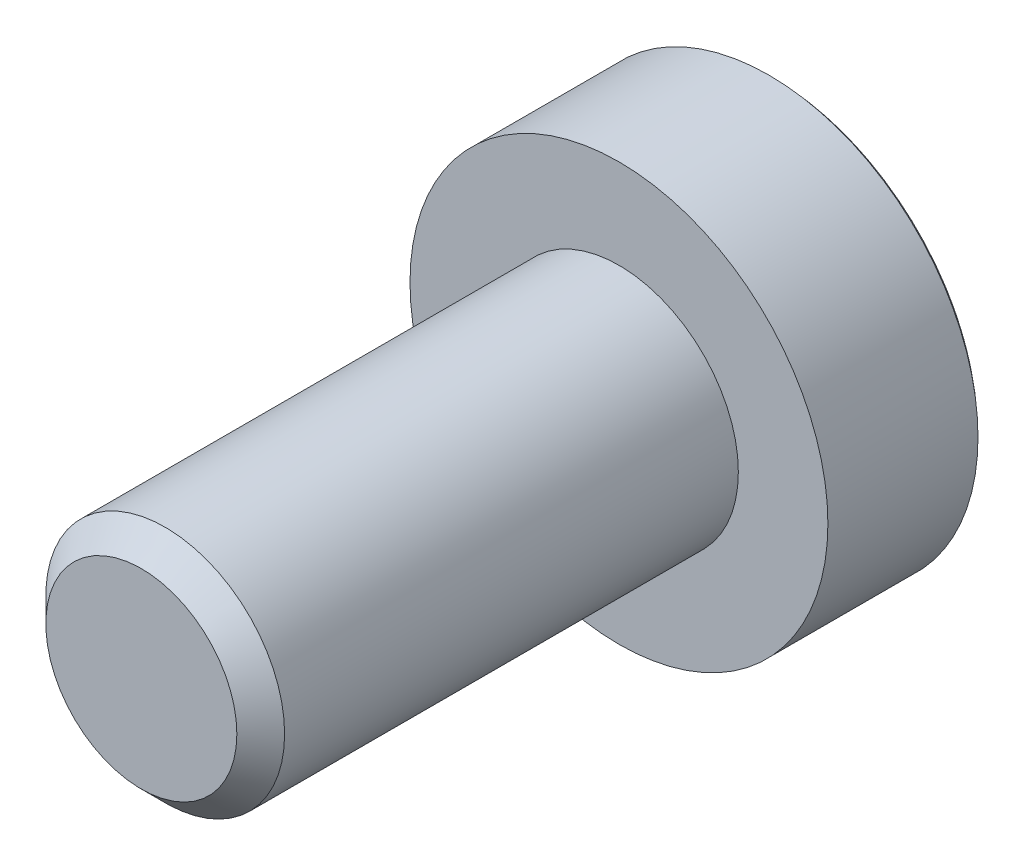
ISO-10303-21;
HEADER;
FILE_DESCRIPTION(('STEP AP214'),'2;1');
FILE_NAME('part.step','',(''),(''),'','','');
FILE_SCHEMA(('AUTOMOTIVE_DESIGN { 1 0 10303 214 1 1 1 1 }'));
ENDSEC;
DATA;
#1=APPLICATION_CONTEXT('core data for automotive mechanical design processes');
#2=APPLICATION_PROTOCOL_DEFINITION('international standard','automotive_design',2000,#1);
#3=PRODUCT_CONTEXT('',#1,'mechanical');
#4=PRODUCT('Part','Part','',(#3));
#5=PRODUCT_RELATED_PRODUCT_CATEGORY('part','',(#4));
#6=PRODUCT_DEFINITION_FORMATION('','',#4);
#7=PRODUCT_DEFINITION_CONTEXT('part definition',#1,'design');
#8=PRODUCT_DEFINITION('design','',#6,#7);
#9=PRODUCT_DEFINITION_SHAPE('','',#8);
#10=(LENGTH_UNIT() NAMED_UNIT(*) SI_UNIT(.MILLI.,.METRE.));
#11=(NAMED_UNIT(*) PLANE_ANGLE_UNIT() SI_UNIT($,.RADIAN.));
#12=(NAMED_UNIT(*) SI_UNIT($,.STERADIAN.) SOLID_ANGLE_UNIT());
#13=UNCERTAINTY_MEASURE_WITH_UNIT(LENGTH_MEASURE(1.E-05),#10,'distance_accuracy_value','');
#14=(GEOMETRIC_REPRESENTATION_CONTEXT(3) GLOBAL_UNCERTAINTY_ASSIGNED_CONTEXT((#13)) GLOBAL_UNIT_ASSIGNED_CONTEXT((#10,
#11,#12)) REPRESENTATION_CONTEXT('',''));
#15=CARTESIAN_POINT('',(0.,0.,0.));
#16=DIRECTION('',(0.,0.,1.));
#17=DIRECTION('',(1.,0.,0.));
#18=AXIS2_PLACEMENT_3D('',#15,#16,#17);
#19=CARTESIAN_POINT('',(0.,0.,1.4));
#20=DIRECTION('',(0.,0.,1.));
#21=DIRECTION('',(1.,0.,0.));
#22=AXIS2_PLACEMENT_3D('',#19,#20,#21);
#23=PLANE('',#22);
#24=CARTESIAN_POINT('',(0.,0.,1.4));
#25=DIRECTION('',(0.,0.,1.));
#26=DIRECTION('',(1.,0.,0.));
#27=AXIS2_PLACEMENT_3D('',#24,#25,#26);
#28=CIRCLE('',#27,1.);
#29=CARTESIAN_POINT('',(1.,0.,1.4));
#30=VERTEX_POINT('',#29);
#31=EDGE_CURVE('E182',#30,#30,#28,.T.);
#32=ORIENTED_EDGE('',*,*,#31,.F.);
#33=EDGE_LOOP('',(#32));
#34=FACE_BOUND('',#33,.T.);
#35=CARTESIAN_POINT('',(0.,0.,1.4));
#36=DIRECTION('',(0.,0.,1.));
#37=DIRECTION('',(1.,0.,0.));
#38=AXIS2_PLACEMENT_3D('',#35,#36,#37);
#39=CIRCLE('',#38,1.75);
#40=CARTESIAN_POINT('',(1.75,0.,1.4));
#41=VERTEX_POINT('',#40);
#42=EDGE_CURVE('E476',#41,#41,#39,.T.);
#43=ORIENTED_EDGE('',*,*,#42,.T.);
#44=EDGE_LOOP('',(#43));
#45=FACE_BOUND('',#44,.T.);
#46=ADVANCED_FACE('F32',(#34,#45),#23,.T.);
#47=CARTESIAN_POINT('',(0.,0.,5.4));
#48=DIRECTION('',(0.,0.,-1.));
#49=DIRECTION('',(-1.,0.,0.));
#50=AXIS2_PLACEMENT_3D('',#47,#48,#49);
#51=CYLINDRICAL_SURFACE('',#50,1.);
#52=CARTESIAN_POINT('',(0.,0.,5.2));
#53=DIRECTION('',(0.,0.,1.));
#54=DIRECTION('',(1.,0.,0.));
#55=AXIS2_PLACEMENT_3D('',#52,#53,#54);
#56=CIRCLE('',#55,1.);
#57=CARTESIAN_POINT('',(1.,0.,5.2));
#58=VERTEX_POINT('',#57);
#59=EDGE_CURVE('E41',#58,#58,#56,.F.);
#60=ORIENTED_EDGE('',*,*,#59,.T.);
#61=EDGE_LOOP('',(#60));
#62=FACE_BOUND('',#61,.T.);
#63=ORIENTED_EDGE('',*,*,#31,.T.);
#64=EDGE_LOOP('',(#63));
#65=FACE_BOUND('',#64,.T.);
#66=ADVANCED_FACE('F274',(#62,#65),#51,.T.);
#67=CARTESIAN_POINT('',(0.,0.,5.4));
#68=DIRECTION('',(0.,0.,1.));
#69=DIRECTION('',(1.,0.,0.));
#70=AXIS2_PLACEMENT_3D('',#67,#68,#69);
#71=PLANE('',#70);
#72=CARTESIAN_POINT('',(0.,0.,5.4));
#73=DIRECTION('',(0.,0.,1.));
#74=DIRECTION('',(1.,0.,0.));
#75=AXIS2_PLACEMENT_3D('',#72,#73,#74);
#76=CIRCLE('',#75,0.8);
#77=CARTESIAN_POINT('',(0.8,0.,5.4));
#78=VERTEX_POINT('',#77);
#79=EDGE_CURVE('E296',#78,#78,#76,.T.);
#80=ORIENTED_EDGE('',*,*,#79,.T.);
#81=EDGE_LOOP('',(#80));
#82=FACE_BOUND('',#81,.T.);
#83=ADVANCED_FACE('F270',(#82),#71,.T.);
#84=CARTESIAN_POINT('',(0.,0.,5.4));
#85=DIRECTION('',(0.,0.,-1.));
#86=DIRECTION('',(-1.,0.,0.));
#87=AXIS2_PLACEMENT_3D('',#84,#85,#86);
#88=CONICAL_SURFACE('',#87,0.8,0.785398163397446);
#89=ORIENTED_EDGE('',*,*,#59,.F.);
#90=EDGE_LOOP('',(#89));
#91=FACE_BOUND('',#90,.T.);
#92=ORIENTED_EDGE('',*,*,#79,.F.);
#93=EDGE_LOOP('',(#92));
#94=FACE_BOUND('',#93,.T.);
#95=ADVANCED_FACE('F273',(#91,#94),#88,.T.);
#96=CARTESIAN_POINT('',(0.,0.,6.));
#97=DIRECTION('',(0.,0.,-1.));
#98=DIRECTION('',(-1.,0.,0.));
#99=AXIS2_PLACEMENT_3D('',#96,#97,#98);
#100=CYLINDRICAL_SURFACE('',#99,1.75);
#101=ORIENTED_EDGE('',*,*,#42,.F.);
#102=EDGE_LOOP('',(#101));
#103=FACE_BOUND('',#102,.T.);
#104=CARTESIAN_POINT('',(0.,0.,0.142928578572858));
#105=DIRECTION('',(0.,0.,1.));
#106=DIRECTION('',(1.,0.,0.));
#107=AXIS2_PLACEMENT_3D('',#104,#105,#106);
#108=CIRCLE('',#107,1.75);
#109=CARTESIAN_POINT('',(1.75,0.,0.142928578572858));
#110=VERTEX_POINT('',#109);
#111=EDGE_CURVE('E36',#110,#110,#108,.F.);
#112=ORIENTED_EDGE('',*,*,#111,.F.);
#113=EDGE_LOOP('',(#112));
#114=FACE_BOUND('',#113,.T.);
#115=ADVANCED_FACE('F284',(#103,#114),#100,.T.);
#116=CARTESIAN_POINT('',(0.,0.,0.5));
#117=DIRECTION('',(0.,0.,-1.));
#118=DIRECTION('',(-1.,0.,0.));
#119=AXIS2_PLACEMENT_3D('',#116,#117,#118);
#120=PLANE('',#119);
#121=CARTESIAN_POINT('',(0.,0.,0.5));
#122=DIRECTION('',(0.,0.,-1.));
#123=DIRECTION('',(-1.,0.,0.));
#124=AXIS2_PLACEMENT_3D('',#121,#122,#123);
#125=CIRCLE('',#124,1.23486161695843);
#126=CARTESIAN_POINT('',(0.211836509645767,-1.2165560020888,0.5));
#127=VERTEX_POINT('',#126);
#128=CARTESIAN_POINT('',(-0.211836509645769,-1.2165560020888,0.5));
#129=VERTEX_POINT('',#128);
#130=EDGE_CURVE('E175',#127,#129,#125,.T.);
#131=ORIENTED_EDGE('',*,*,#130,.T.);
#132=DIRECTION('',(0.,1.,0.));
#133=VECTOR('',#132,1.);
#134=CARTESIAN_POINT('',(-0.211836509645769,0.,0.5));
#135=LINE('',#134,#133);
#136=CARTESIAN_POINT('',(-0.211836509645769,-0.211846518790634,0.5));
#137=VERTEX_POINT('',#136);
#138=EDGE_CURVE('E302',#129,#137,#135,.T.);
#139=ORIENTED_EDGE('',*,*,#138,.T.);
#140=DIRECTION('',(-1.,0.,0.));
#141=VECTOR('',#140,1.);
#142=CARTESIAN_POINT('',(0.,-0.211846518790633,0.5));
#143=LINE('',#142,#141);
#144=CARTESIAN_POINT('',(-1.21655425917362,-0.211846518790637,0.5));
#145=VERTEX_POINT('',#144);
#146=EDGE_CURVE('E134',#137,#145,#143,.T.);
#147=ORIENTED_EDGE('',*,*,#146,.T.);
#148=CARTESIAN_POINT('',(0.,0.,0.5));
#149=DIRECTION('',(0.,0.,-1.));
#150=DIRECTION('',(-1.,0.,0.));
#151=AXIS2_PLACEMENT_3D('',#148,#149,#150);
#152=CIRCLE('',#151,1.23486161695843);
#153=CARTESIAN_POINT('',(-1.21784768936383,0.204279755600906,0.5));
#154=VERTEX_POINT('',#153);
#155=EDGE_CURVE('E305',#145,#154,#152,.T.);
#156=ORIENTED_EDGE('',*,*,#155,.T.);
#157=DIRECTION('',(1.,0.,0.));
#158=VECTOR('',#157,1.);
#159=CARTESIAN_POINT('',(0.,0.20427975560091,0.5));
#160=LINE('',#159,#158);
#161=CARTESIAN_POINT('',(-0.211836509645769,0.204279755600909,0.5));
#162=VERTEX_POINT('',#161);
#163=EDGE_CURVE('E308',#154,#162,#160,.T.);
#164=ORIENTED_EDGE('',*,*,#163,.T.);
#165=DIRECTION('',(0.,1.,0.));
#166=VECTOR('',#165,1.);
#167=CARTESIAN_POINT('',(-0.211836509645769,0.,0.5));
#168=LINE('',#167,#166);
#169=CARTESIAN_POINT('',(-0.211836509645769,1.2165560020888,0.5));
#170=VERTEX_POINT('',#169);
#171=EDGE_CURVE('E311',#162,#170,#168,.T.);
#172=ORIENTED_EDGE('',*,*,#171,.T.);
#173=CARTESIAN_POINT('',(0.,0.,0.5));
#174=DIRECTION('',(0.,0.,-1.));
#175=DIRECTION('',(-1.,0.,0.));
#176=AXIS2_PLACEMENT_3D('',#173,#174,#175);
#177=CIRCLE('',#176,1.23486161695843);
#178=CARTESIAN_POINT('',(0.211836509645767,1.2165560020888,0.5));
#179=VERTEX_POINT('',#178);
#180=EDGE_CURVE('E314',#170,#179,#177,.T.);
#181=ORIENTED_EDGE('',*,*,#180,.T.);
#182=DIRECTION('',(0.,-1.,0.));
#183=VECTOR('',#182,1.);
#184=CARTESIAN_POINT('',(0.211836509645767,0.,0.5));
#185=LINE('',#184,#183);
#186=CARTESIAN_POINT('',(0.211836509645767,0.20427975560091,0.5));
#187=VERTEX_POINT('',#186);
#188=EDGE_CURVE('E317',#179,#187,#185,.T.);
#189=ORIENTED_EDGE('',*,*,#188,.T.);
#190=DIRECTION('',(1.,0.,0.));
#191=VECTOR('',#190,1.);
#192=CARTESIAN_POINT('',(0.,0.20427975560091,0.5));
#193=LINE('',#192,#191);
#194=CARTESIAN_POINT('',(1.21784768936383,0.204279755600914,0.5));
#195=VERTEX_POINT('',#194);
#196=EDGE_CURVE('E320',#187,#195,#193,.T.);
#197=ORIENTED_EDGE('',*,*,#196,.T.);
#198=CARTESIAN_POINT('',(0.,0.,0.5));
#199=DIRECTION('',(0.,0.,-1.));
#200=DIRECTION('',(-1.,0.,0.));
#201=AXIS2_PLACEMENT_3D('',#198,#199,#200);
#202=CIRCLE('',#201,1.23486161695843);
#203=CARTESIAN_POINT('',(1.21655425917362,-0.211846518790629,0.5));
#204=VERTEX_POINT('',#203);
#205=EDGE_CURVE('E323',#195,#204,#202,.T.);
#206=ORIENTED_EDGE('',*,*,#205,.T.);
#207=DIRECTION('',(-1.,0.,0.));
#208=VECTOR('',#207,1.);
#209=CARTESIAN_POINT('',(0.,-0.211846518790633,0.5));
#210=LINE('',#209,#208);
#211=CARTESIAN_POINT('',(0.211836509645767,-0.211846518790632,0.5));
#212=VERTEX_POINT('',#211);
#213=EDGE_CURVE('E326',#204,#212,#210,.T.);
#214=ORIENTED_EDGE('',*,*,#213,.T.);
#215=DIRECTION('',(0.,-1.,0.));
#216=VECTOR('',#215,1.);
#217=CARTESIAN_POINT('',(0.211836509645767,0.,0.5));
#218=LINE('',#217,#216);
#219=EDGE_CURVE('E329',#212,#127,#218,.T.);
#220=ORIENTED_EDGE('',*,*,#219,.T.);
#221=EDGE_LOOP('',(#131,#139,#147,#156,#164,#172,#181,#189,#197,#206,#214,#220));
#222=FACE_BOUND('',#221,.T.);
#223=ADVANCED_FACE('F201',(#222),#120,.T.);
#224=CARTESIAN_POINT('',(-1.28856099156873,-0.30001000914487,0.));
#225=DIRECTION('',(0.,-0.984807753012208,0.173648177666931));
#226=DIRECTION('',(0.,-0.173648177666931,-0.984807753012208));
#227=AXIS2_PLACEMENT_3D('',#224,#225,#226);
#228=PLANE('',#227);
#229=DIRECTION('',(-1.,0.,0.));
#230=VECTOR('',#229,1.);
#231=CARTESIAN_POINT('',(-1.28856099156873,-0.30001000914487,0.));
#232=LINE('',#231,#230);
#233=CARTESIAN_POINT('',(-0.300000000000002,-0.300010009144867,0.));
#234=VERTEX_POINT('',#233);
#235=CARTESIAN_POINT('',(-1.28856099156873,-0.300010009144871,0.));
#236=VERTEX_POINT('',#235);
#237=EDGE_CURVE('E131',#234,#236,#232,.T.);
#238=ORIENTED_EDGE('',*,*,#237,.T.);
#239=CARTESIAN_POINT('',(-1.21655425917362,-0.211846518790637,0.5));
#240=CARTESIAN_POINT('',(-1.22889347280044,-0.226532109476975,0.416713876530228));
#241=CARTESIAN_POINT('',(-1.24106364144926,-0.241221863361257,0.333404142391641));
#242=CARTESIAN_POINT('',(-1.26506588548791,-0.270609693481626,0.166737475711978));
#243=CARTESIAN_POINT('',(-1.2768979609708,-0.285307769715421,0.0833805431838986));
#244=CARTESIAN_POINT('',(-1.28856099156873,-0.30001000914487,0.));
#245=B_SPLINE_CURVE_WITH_KNOTS('',3,(#239,#240,#241,#242,#243,#244),.UNSPECIFIED.,.F.,.F.,(4,2,
4),(0.,0.256397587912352,0.512795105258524),.UNSPECIFIED.);
#246=EDGE_CURVE('E137',#145,#236,#245,.T.);
#247=ORIENTED_EDGE('',*,*,#246,.F.);
#248=ORIENTED_EDGE('',*,*,#146,.F.);
#249=DIRECTION('',(-0.171087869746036,-0.171087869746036,-0.970287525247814));
#250=VECTOR('',#249,1.);
#251=CARTESIAN_POINT('',(-0.328936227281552,-0.328946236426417,-0.164105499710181));
#252=LINE('',#251,#250);
#253=EDGE_CURVE('E127',#137,#234,#252,.T.);
#254=ORIENTED_EDGE('',*,*,#253,.T.);
#255=EDGE_LOOP('',(#238,#247,#248,#254));
#256=FACE_BOUND('',#255,.T.);
#257=ADVANCED_FACE('F129',(#256),#228,.F.);
#258=CARTESIAN_POINT('',(0.,0.,0.));
#259=DIRECTION('',(0.,0.,-1.));
#260=DIRECTION('',(-1.,0.,0.));
#261=AXIS2_PLACEMENT_3D('',#258,#259,#260);
#262=CONICAL_SURFACE('',#261,1.32302510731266,0.174532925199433);
#263=CARTESIAN_POINT('',(0.,0.,0.));
#264=DIRECTION('',(0.,0.,-1.));
#265=DIRECTION('',(-1.,0.,0.));
#266=AXIS2_PLACEMENT_3D('',#263,#264,#265);
#267=CIRCLE('',#266,1.32302510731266);
#268=CARTESIAN_POINT('',(-1.29029933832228,0.292443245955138,0.));
#269=VERTEX_POINT('',#268);
#270=EDGE_CURVE('E148',#236,#269,#267,.T.);
#271=ORIENTED_EDGE('',*,*,#270,.T.);
#272=CARTESIAN_POINT('',(-1.21784768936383,0.204279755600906,0.5));
#273=CARTESIAN_POINT('',(-1.23026474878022,0.218965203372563,0.416714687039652));
#274=CARTESIAN_POINT('',(-1.24251091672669,0.23365488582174,0.333405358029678));
#275=CARTESIAN_POINT('',(-1.26666146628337,0.2630427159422,0.166738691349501));
#276=CARTESIAN_POINT('',(-1.27856584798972,0.2777408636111,0.083381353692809));
#277=CARTESIAN_POINT('',(-1.29029933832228,0.292443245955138,0.));
#278=B_SPLINE_CURVE_WITH_KNOTS('',3,(#272,#273,#274,#275,#276,#277),.UNSPECIFIED.,.F.,.F.,(4,2,
4),(0.,0.25642893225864,0.512857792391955),.UNSPECIFIED.);
#279=EDGE_CURVE('E209',#154,#269,#278,.T.);
#280=ORIENTED_EDGE('',*,*,#279,.F.);
#281=ORIENTED_EDGE('',*,*,#155,.F.);
#282=ORIENTED_EDGE('',*,*,#246,.T.);
#283=EDGE_LOOP('',(#271,#280,#281,#282));
#284=FACE_BOUND('',#283,.T.);
#285=ADVANCED_FACE('F200',(#284),#262,.F.);
#286=CARTESIAN_POINT('',(-1.29029933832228,0.292443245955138,0.));
#287=DIRECTION('',(0.,0.984807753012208,0.173648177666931));
#288=DIRECTION('',(0.,-0.173648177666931,0.984807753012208));
#289=AXIS2_PLACEMENT_3D('',#286,#287,#288);
#290=PLANE('',#289);
#291=DIRECTION('',(1.,0.,0.));
#292=VECTOR('',#291,1.);
#293=CARTESIAN_POINT('',(-1.29029933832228,0.292443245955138,0.));
#294=LINE('',#293,#292);
#295=CARTESIAN_POINT('',(-0.300000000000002,0.292443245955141,0.));
#296=VERTEX_POINT('',#295);
#297=EDGE_CURVE('E150',#269,#296,#294,.T.);
#298=ORIENTED_EDGE('',*,*,#297,.T.);
#299=DIRECTION('',(-0.171087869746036,0.171087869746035,-0.970287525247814));
#300=VECTOR('',#299,1.);
#301=CARTESIAN_POINT('',(-0.329157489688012,0.321600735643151,-0.165360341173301));
#302=LINE('',#301,#300);
#303=EDGE_CURVE('E214',#162,#296,#302,.T.);
#304=ORIENTED_EDGE('',*,*,#303,.F.);
#305=ORIENTED_EDGE('',*,*,#163,.F.);
#306=ORIENTED_EDGE('',*,*,#279,.T.);
#307=EDGE_LOOP('',(#298,#304,#305,#306));
#308=FACE_BOUND('',#307,.T.);
#309=ADVANCED_FACE('F216',(#308),#290,.F.);
#310=CARTESIAN_POINT('',(-0.300000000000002,1.28856332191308,0.));
#311=DIRECTION('',(-0.984807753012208,0.,0.173648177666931));
#312=DIRECTION('',(0.173648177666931,0.,0.984807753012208));
#313=AXIS2_PLACEMENT_3D('',#310,#311,#312);
#314=PLANE('',#313);
#315=DIRECTION('',(0.,1.,0.));
#316=VECTOR('',#315,1.);
#317=CARTESIAN_POINT('',(-0.300000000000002,1.28856332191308,0.));
#318=LINE('',#317,#316);
#319=CARTESIAN_POINT('',(-0.300000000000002,1.28856332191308,0.));
#320=VERTEX_POINT('',#319);
#321=EDGE_CURVE('E156',#296,#320,#318,.T.);
#322=ORIENTED_EDGE('',*,*,#321,.T.);
#323=CARTESIAN_POINT('',(-0.211836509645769,1.2165560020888,0.5));
#324=CARTESIAN_POINT('',(-0.226522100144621,1.22889531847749,0.416713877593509));
#325=CARTESIAN_POINT('',(-0.24121185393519,1.2410655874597,0.333404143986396));
#326=CARTESIAN_POINT('',(-0.270599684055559,1.26506802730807,0.166737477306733));
#327=CARTESIAN_POINT('',(-0.285297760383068,1.27690019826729,0.0833805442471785));
#328=CARTESIAN_POINT('',(-0.300000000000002,1.28856332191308,0.));
#329=B_SPLINE_CURVE_WITH_KNOTS('',3,(#323,#324,#325,#326,#327,#328),.UNSPECIFIED.,.F.,.F.,(4,2,
4),(0.,0.256397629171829,0.512795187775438),.UNSPECIFIED.);
#330=EDGE_CURVE('E229',#170,#320,#329,.T.);
#331=ORIENTED_EDGE('',*,*,#330,.F.);
#332=ORIENTED_EDGE('',*,*,#171,.F.);
#333=ORIENTED_EDGE('',*,*,#303,.T.);
#334=EDGE_LOOP('',(#322,#331,#332,#333));
#335=FACE_BOUND('',#334,.T.);
#336=ADVANCED_FACE('F220',(#335),#314,.F.);
#337=CARTESIAN_POINT('',(0.,0.,0.));
#338=DIRECTION('',(0.,0.,-1.));
#339=DIRECTION('',(-1.,0.,0.));
#340=AXIS2_PLACEMENT_3D('',#337,#338,#339);
#341=CONICAL_SURFACE('',#340,1.32302510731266,0.174532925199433);
#342=CARTESIAN_POINT('',(0.,0.,0.));
#343=DIRECTION('',(0.,0.,-1.));
#344=DIRECTION('',(-1.,0.,0.));
#345=AXIS2_PLACEMENT_3D('',#342,#343,#344);
#346=CIRCLE('',#345,1.32302510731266);
#347=CARTESIAN_POINT('',(0.3,1.28856332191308,0.));
#348=VERTEX_POINT('',#347);
#349=EDGE_CURVE('E159',#320,#348,#346,.T.);
#350=ORIENTED_EDGE('',*,*,#349,.T.);
#351=CARTESIAN_POINT('',(0.211836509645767,1.2165560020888,0.5));
#352=CARTESIAN_POINT('',(0.22652210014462,1.22889531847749,0.416713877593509));
#353=CARTESIAN_POINT('',(0.241211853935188,1.2410655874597,0.333404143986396));
#354=CARTESIAN_POINT('',(0.270599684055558,1.26506802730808,0.166737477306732));
#355=CARTESIAN_POINT('',(0.285297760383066,1.27690019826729,0.0833805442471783));
#356=CARTESIAN_POINT('',(0.3,1.28856332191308,0.));
#357=B_SPLINE_CURVE_WITH_KNOTS('',3,(#351,#352,#353,#354,#355,#356),.UNSPECIFIED.,.F.,.F.,(4,2,
4),(0.,0.256397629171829,0.512795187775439),.UNSPECIFIED.);
#358=EDGE_CURVE('E234',#179,#348,#357,.T.);
#359=ORIENTED_EDGE('',*,*,#358,.F.);
#360=ORIENTED_EDGE('',*,*,#180,.F.);
#361=ORIENTED_EDGE('',*,*,#330,.T.);
#362=EDGE_LOOP('',(#350,#359,#360,#361));
#363=FACE_BOUND('',#362,.T.);
#364=ADVANCED_FACE('F225',(#363),#341,.F.);
#365=CARTESIAN_POINT('',(0.3,1.28856332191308,0.));
#366=DIRECTION('',(0.984807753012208,0.,0.173648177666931));
#367=DIRECTION('',(0.173648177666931,0.,-0.984807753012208));
#368=AXIS2_PLACEMENT_3D('',#365,#366,#367);
#369=PLANE('',#368);
#370=DIRECTION('',(0.,-1.,0.));
#371=VECTOR('',#370,1.);
#372=CARTESIAN_POINT('',(0.3,1.28856332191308,0.));
#373=LINE('',#372,#371);
#374=CARTESIAN_POINT('',(0.3,0.292443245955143,0.));
#375=VERTEX_POINT('',#374);
#376=EDGE_CURVE('E162',#348,#375,#373,.T.);
#377=ORIENTED_EDGE('',*,*,#376,.T.);
#378=DIRECTION('',(0.171087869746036,0.171087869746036,-0.970287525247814));
#379=VECTOR('',#378,1.);
#380=CARTESIAN_POINT('',(0.3,0.292443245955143,0.));
#381=LINE('',#380,#379);
#382=EDGE_CURVE('E239',#187,#375,#381,.T.);
#383=ORIENTED_EDGE('',*,*,#382,.F.);
#384=ORIENTED_EDGE('',*,*,#188,.F.);
#385=ORIENTED_EDGE('',*,*,#358,.T.);
#386=EDGE_LOOP('',(#377,#383,#384,#385));
#387=FACE_BOUND('',#386,.T.);
#388=ADVANCED_FACE('F241',(#387),#369,.F.);
#389=CARTESIAN_POINT('',(0.3,0.292443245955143,0.));
#390=DIRECTION('',(0.,0.984807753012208,0.173648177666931));
#391=DIRECTION('',(0.,-0.173648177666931,0.984807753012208));
#392=AXIS2_PLACEMENT_3D('',#389,#390,#391);
#393=PLANE('',#392);
#394=DIRECTION('',(1.,0.,0.));
#395=VECTOR('',#394,1.);
#396=CARTESIAN_POINT('',(0.3,0.292443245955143,0.));
#397=LINE('',#396,#395);
#398=CARTESIAN_POINT('',(1.29029933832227,0.292443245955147,0.));
#399=VERTEX_POINT('',#398);
#400=EDGE_CURVE('E165',#375,#399,#397,.T.);
#401=ORIENTED_EDGE('',*,*,#400,.T.);
#402=CARTESIAN_POINT('',(1.21784768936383,0.204279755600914,0.5));
#403=CARTESIAN_POINT('',(1.23026474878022,0.218965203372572,0.416714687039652));
#404=CARTESIAN_POINT('',(1.24251091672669,0.233654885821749,0.333405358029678));
#405=CARTESIAN_POINT('',(1.26666146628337,0.263042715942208,0.166738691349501));
#406=CARTESIAN_POINT('',(1.27856584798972,0.277740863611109,0.0833813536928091));
#407=CARTESIAN_POINT('',(1.29029933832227,0.292443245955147,0.));
#408=B_SPLINE_CURVE_WITH_KNOTS('',3,(#402,#403,#404,#405,#406,#407),.UNSPECIFIED.,.F.,.F.,(4,2,
4),(0.,0.25642893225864,0.512857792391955),.UNSPECIFIED.);
#409=EDGE_CURVE('E254',#195,#399,#408,.T.);
#410=ORIENTED_EDGE('',*,*,#409,.F.);
#411=ORIENTED_EDGE('',*,*,#196,.F.);
#412=ORIENTED_EDGE('',*,*,#382,.T.);
#413=EDGE_LOOP('',(#401,#410,#411,#412));
#414=FACE_BOUND('',#413,.T.);
#415=ADVANCED_FACE('F245',(#414),#393,.F.);
#416=CARTESIAN_POINT('',(0.,0.,0.));
#417=DIRECTION('',(0.,0.,-1.));
#418=DIRECTION('',(-1.,0.,0.));
#419=AXIS2_PLACEMENT_3D('',#416,#417,#418);
#420=CONICAL_SURFACE('',#419,1.32302510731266,0.174532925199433);
#421=CARTESIAN_POINT('',(0.,0.,0.));
#422=DIRECTION('',(0.,0.,-1.));
#423=DIRECTION('',(-1.,0.,0.));
#424=AXIS2_PLACEMENT_3D('',#421,#422,#423);
#425=CIRCLE('',#424,1.32302510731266);
#426=CARTESIAN_POINT('',(1.28856099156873,-0.300010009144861,0.));
#427=VERTEX_POINT('',#426);
#428=EDGE_CURVE('E168',#399,#427,#425,.T.);
#429=ORIENTED_EDGE('',*,*,#428,.T.);
#430=CARTESIAN_POINT('',(1.21655425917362,-0.211846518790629,0.5));
#431=CARTESIAN_POINT('',(1.22889347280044,-0.226532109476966,0.416713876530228));
#432=CARTESIAN_POINT('',(1.24106364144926,-0.241221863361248,0.333404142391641));
#433=CARTESIAN_POINT('',(1.26506588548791,-0.270609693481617,0.166737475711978));
#434=CARTESIAN_POINT('',(1.2768979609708,-0.285307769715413,0.0833805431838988));
#435=CARTESIAN_POINT('',(1.28856099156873,-0.300010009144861,0.));
#436=B_SPLINE_CURVE_WITH_KNOTS('',3,(#430,#431,#432,#433,#434,#435),.UNSPECIFIED.,.F.,.F.,(4,2,
4),(0.,0.256397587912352,0.512795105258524),.UNSPECIFIED.);
#437=EDGE_CURVE('E259',#204,#427,#436,.T.);
#438=ORIENTED_EDGE('',*,*,#437,.F.);
#439=ORIENTED_EDGE('',*,*,#205,.F.);
#440=ORIENTED_EDGE('',*,*,#409,.T.);
#441=EDGE_LOOP('',(#429,#438,#439,#440));
#442=FACE_BOUND('',#441,.T.);
#443=ADVANCED_FACE('F250',(#442),#420,.F.);
#444=CARTESIAN_POINT('',(0.3,-0.300010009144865,0.));
#445=DIRECTION('',(0.,-0.984807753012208,0.173648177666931));
#446=DIRECTION('',(0.,-0.173648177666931,-0.984807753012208));
#447=AXIS2_PLACEMENT_3D('',#444,#445,#446);
#448=PLANE('',#447);
#449=DIRECTION('',(-1.,0.,0.));
#450=VECTOR('',#449,1.);
#451=CARTESIAN_POINT('',(0.3,-0.300010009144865,0.));
#452=LINE('',#451,#450);
#453=CARTESIAN_POINT('',(0.3,-0.300010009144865,0.));
#454=VERTEX_POINT('',#453);
#455=EDGE_CURVE('E171',#427,#454,#452,.T.);
#456=ORIENTED_EDGE('',*,*,#455,.T.);
#457=DIRECTION('',(0.171087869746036,-0.171087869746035,-0.970287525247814));
#458=VECTOR('',#457,1.);
#459=CARTESIAN_POINT('',(0.3,-0.300010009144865,0.));
#460=LINE('',#459,#458);
#461=EDGE_CURVE('E96',#212,#454,#460,.T.);
#462=ORIENTED_EDGE('',*,*,#461,.F.);
#463=ORIENTED_EDGE('',*,*,#213,.F.);
#464=ORIENTED_EDGE('',*,*,#437,.T.);
#465=EDGE_LOOP('',(#456,#462,#463,#464));
#466=FACE_BOUND('',#465,.T.);
#467=ADVANCED_FACE('F265',(#466),#448,.F.);
#468=CARTESIAN_POINT('',(0.3,-0.300010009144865,0.));
#469=DIRECTION('',(0.984807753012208,0.,0.173648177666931));
#470=DIRECTION('',(0.173648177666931,0.,-0.984807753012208));
#471=AXIS2_PLACEMENT_3D('',#468,#469,#470);
#472=PLANE('',#471);
#473=DIRECTION('',(0.,-1.,0.));
#474=VECTOR('',#473,1.);
#475=CARTESIAN_POINT('',(0.3,-0.300010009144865,0.));
#476=LINE('',#475,#474);
#477=CARTESIAN_POINT('',(0.3,-1.28856332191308,0.));
#478=VERTEX_POINT('',#477);
#479=EDGE_CURVE('E173',#454,#478,#476,.T.);
#480=ORIENTED_EDGE('',*,*,#479,.T.);
#481=CARTESIAN_POINT('',(0.211836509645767,-1.2165560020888,0.5));
#482=CARTESIAN_POINT('',(0.226522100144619,-1.22889531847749,0.416713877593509));
#483=CARTESIAN_POINT('',(0.241211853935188,-1.2410655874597,0.333404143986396));
#484=CARTESIAN_POINT('',(0.270599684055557,-1.26506802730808,0.166737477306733));
#485=CARTESIAN_POINT('',(0.285297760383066,-1.27690019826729,0.0833805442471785));
#486=CARTESIAN_POINT('',(0.3,-1.28856332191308,0.));
#487=B_SPLINE_CURVE_WITH_KNOTS('',3,(#481,#482,#483,#484,#485,#486),.UNSPECIFIED.,.F.,.F.,(4,2,
4),(0.,0.256397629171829,0.512795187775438),.UNSPECIFIED.);
#488=EDGE_CURVE('E56',#127,#478,#487,.T.);
#489=ORIENTED_EDGE('',*,*,#488,.F.);
#490=ORIENTED_EDGE('',*,*,#219,.F.);
#491=ORIENTED_EDGE('',*,*,#461,.T.);
#492=EDGE_LOOP('',(#480,#489,#490,#491));
#493=FACE_BOUND('',#492,.T.);
#494=ADVANCED_FACE('F187',(#493),#472,.F.);
#495=CARTESIAN_POINT('',(0.,0.,0.));
#496=DIRECTION('',(0.,0.,-1.));
#497=DIRECTION('',(-1.,0.,0.));
#498=AXIS2_PLACEMENT_3D('',#495,#496,#497);
#499=CONICAL_SURFACE('',#498,1.32302510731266,0.174532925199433);
#500=CARTESIAN_POINT('',(0.,0.,0.));
#501=DIRECTION('',(0.,0.,-1.));
#502=DIRECTION('',(-1.,0.,0.));
#503=AXIS2_PLACEMENT_3D('',#500,#501,#502);
#504=CIRCLE('',#503,1.32302510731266);
#505=CARTESIAN_POINT('',(-0.300000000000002,-1.28856332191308,0.));
#506=VERTEX_POINT('',#505);
#507=EDGE_CURVE('E48',#478,#506,#504,.T.);
#508=ORIENTED_EDGE('',*,*,#507,.T.);
#509=CARTESIAN_POINT('',(-0.211836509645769,-1.2165560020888,0.5));
#510=CARTESIAN_POINT('',(-0.226522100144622,-1.22889531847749,0.416713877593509));
#511=CARTESIAN_POINT('',(-0.24121185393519,-1.2410655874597,0.333404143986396));
#512=CARTESIAN_POINT('',(-0.27059968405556,-1.26506802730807,0.166737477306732));
#513=CARTESIAN_POINT('',(-0.285297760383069,-1.27690019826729,0.0833805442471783));
#514=CARTESIAN_POINT('',(-0.300000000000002,-1.28856332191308,0.));
#515=B_SPLINE_CURVE_WITH_KNOTS('',3,(#509,#510,#511,#512,#513,#514),.UNSPECIFIED.,.F.,.F.,(4,2,
4),(0.,0.256397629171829,0.512795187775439),.UNSPECIFIED.);
#516=EDGE_CURVE('E91',#129,#506,#515,.T.);
#517=ORIENTED_EDGE('',*,*,#516,.F.);
#518=ORIENTED_EDGE('',*,*,#130,.F.);
#519=ORIENTED_EDGE('',*,*,#488,.T.);
#520=EDGE_LOOP('',(#508,#517,#518,#519));
#521=FACE_BOUND('',#520,.T.);
#522=ADVANCED_FACE('F190',(#521),#499,.F.);
#523=CARTESIAN_POINT('',(-0.300000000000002,-0.300010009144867,0.));
#524=DIRECTION('',(-0.984807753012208,0.,0.173648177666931));
#525=DIRECTION('',(0.173648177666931,0.,0.984807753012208));
#526=AXIS2_PLACEMENT_3D('',#523,#524,#525);
#527=PLANE('',#526);
#528=DIRECTION('',(0.,1.,0.));
#529=VECTOR('',#528,1.);
#530=CARTESIAN_POINT('',(-0.300000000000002,-0.300010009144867,0.));
#531=LINE('',#530,#529);
#532=EDGE_CURVE('E140',#506,#234,#531,.T.);
#533=ORIENTED_EDGE('',*,*,#532,.T.);
#534=ORIENTED_EDGE('',*,*,#253,.F.);
#535=ORIENTED_EDGE('',*,*,#138,.F.);
#536=ORIENTED_EDGE('',*,*,#516,.T.);
#537=EDGE_LOOP('',(#533,#534,#535,#536));
#538=FACE_BOUND('',#537,.T.);
#539=ADVANCED_FACE('F141',(#538),#527,.F.);
#540=CARTESIAN_POINT('',(0.,0.,0.));
#541=DIRECTION('',(0.,0.,1.));
#542=DIRECTION('',(1.,0.,0.));
#543=AXIS2_PLACEMENT_3D('',#540,#541,#542);
#544=PLANE('',#543);
#545=ORIENTED_EDGE('',*,*,#532,.F.);
#546=ORIENTED_EDGE('',*,*,#507,.F.);
#547=ORIENTED_EDGE('',*,*,#479,.F.);
#548=ORIENTED_EDGE('',*,*,#455,.F.);
#549=ORIENTED_EDGE('',*,*,#428,.F.);
#550=ORIENTED_EDGE('',*,*,#400,.F.);
#551=ORIENTED_EDGE('',*,*,#376,.F.);
#552=ORIENTED_EDGE('',*,*,#349,.F.);
#553=ORIENTED_EDGE('',*,*,#321,.F.);
#554=ORIENTED_EDGE('',*,*,#297,.F.);
#555=ORIENTED_EDGE('',*,*,#270,.F.);
#556=ORIENTED_EDGE('',*,*,#237,.F.);
#557=EDGE_LOOP('',(#545,#546,#547,#548,#549,#550,#551,#552,#553,#554,#555,#556));
#558=FACE_BOUND('',#557,.T.);
#559=CARTESIAN_POINT('',(0.,0.,0.));
#560=DIRECTION('',(0.,0.,1.));
#561=DIRECTION('',(1.,0.,0.));
#562=AXIS2_PLACEMENT_3D('',#559,#560,#561);
#563=CIRCLE('',#562,1.4);
#564=CARTESIAN_POINT('',(1.4,0.,0.));
#565=VERTEX_POINT('',#564);
#566=EDGE_CURVE('E12',#565,#565,#563,.F.);
#567=ORIENTED_EDGE('',*,*,#566,.T.);
#568=EDGE_LOOP('',(#567));
#569=FACE_BOUND('',#568,.T.);
#570=ADVANCED_FACE('F144',(#558,#569),#544,.F.);
#571=CARTESIAN_POINT('',(0.,0.,0.5));
#572=DIRECTION('',(0.,0.,1.));
#573=DIRECTION('',(1.,0.,0.));
#574=AXIS2_PLACEMENT_3D('',#571,#572,#573);
#575=TOROIDAL_SURFACE('',#574,1.4,0.5);
#576=ORIENTED_EDGE('',*,*,#566,.F.);
#577=EDGE_LOOP('',(#576));
#578=FACE_BOUND('',#577,.T.);
#579=ORIENTED_EDGE('',*,*,#111,.T.);
#580=EDGE_LOOP('',(#579));
#581=FACE_BOUND('',#580,.T.);
#582=ADVANCED_FACE('F34',(#578,#581),#575,.T.);
#583=CLOSED_SHELL('',(#46,#66,#83,#95,#115,#223,#257,#285,#309,#336,#364,#388,#415,#443,#467,
#494,#522,#539,#570,#582));
#584=MANIFOLD_SOLID_BREP('B2',#583);
#585=ADVANCED_BREP_SHAPE_REPRESENTATION('',(#18,#584),#14);
#586=SHAPE_DEFINITION_REPRESENTATION(#9,#585);
ENDSEC;
END-ISO-10303-21;
